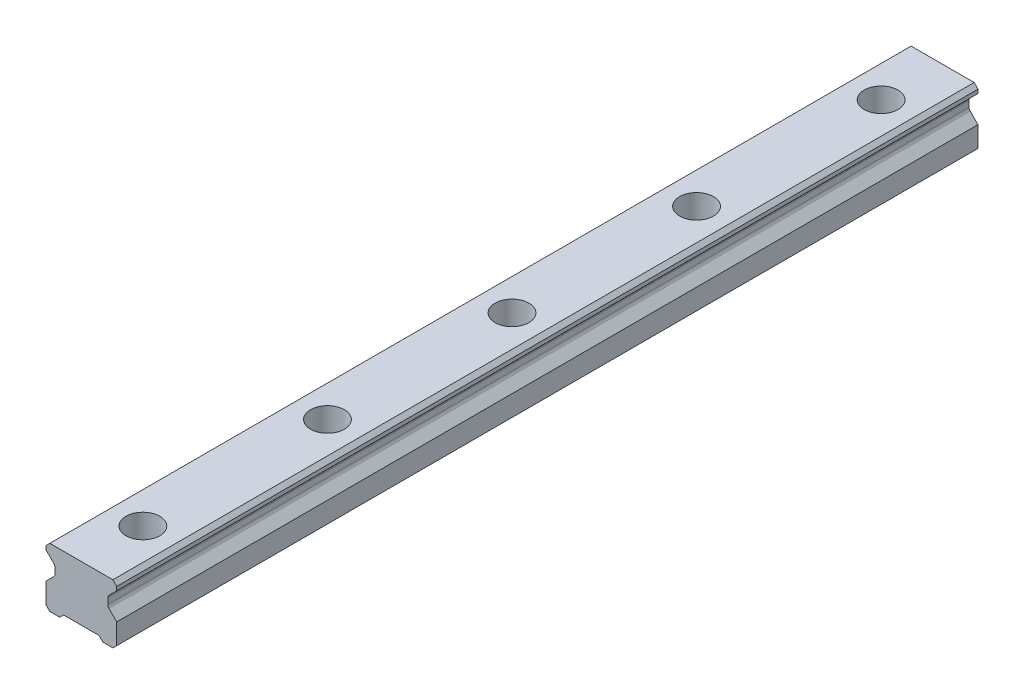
from build123d import *

# Parameters (mm, degrees)
SKETCH1_W           = 23
SKETCH1_H           = 19.2
BOSS_EXTRUDE1_DEPTH = 140
CUT_EXTRUDE1_DEPTH  = 281.893022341
CHAMFER1_SIZE       = 1.25
FILLET1_R           = 1.25
CUT_EXTRUDE2_DEPTH  = 281.893022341
SKETCH4_R           = 5.5
SKETCH4_R_2         = 3.5
CUT_EXTRUDE3_DEPTH  = 9
SKETCH4_2_R         = 3.5
CUT_EXTRUDE4_DEPTH  = 142.777607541
LPATTERN1_COUNT     = 5
LPATTERN1_PITCH     = 60


with BuildPart() as part:
    # Sketch1 → Boss-Extrude1 (new, symmetric)
    with BuildSketch(Plane.XY):
        with Locations((0, 9.6)):
            Rectangle(SKETCH1_W, SKETCH1_H)
    extrude(amount=BOSS_EXTRUDE1_DEPTH, both=True)

    # Sketch2 → Cut-Extrude1 (cut, through all)
    with BuildSketch(Plane.XY.offset(140)):
        Polygon((-11.5, 16.7), (-11.5, 7.95), (-8.583333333, 10.866666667), (-8.583333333, 13.783333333), align=None)
        Polygon((8.583333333, 13.783333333), (11.5, 16.7), (11.5, 7.95), (8.583333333, 10.866666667), align=None)
    extrude(amount=-CUT_EXTRUDE1_DEPTH, mode=Mode.SUBTRACT)

    # Chamfer1
    chamfer1_edges = [part.edges().sort_by_distance(p)[0] for p in [
        (-11.5, 19.2, 0),
        (11.5, 19.2, 0),
        (11.5, 0, 0),
        (-11.5, 0, 0),
    ]]
    chamfer(chamfer1_edges, length=CHAMFER1_SIZE)

    # Fillet1
    fillet1_edges = [part.edges().sort_by_distance(p)[0] for p in [
        (-8.583333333, 13.783333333, 0),
        (-8.583333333, 10.866666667, 0),
        (8.583333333, 10.866666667, 0),
        (8.583333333, 13.783333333, 0),
    ]]
    fillet(fillet1_edges, radius=FILLET1_R)

    # Sketch3 → Cut-Extrude2 (cut, through all)
    with BuildSketch(Plane.XY.offset(140)):
        Polygon((-7, 0), (-5.75, 1.25), (5.75, 1.25), (7, 0), align=None)
    extrude(amount=-CUT_EXTRUDE2_DEPTH, mode=Mode.SUBTRACT)

    # Sketch4 → Cut-Extrude3 (cut)
    with BuildSketch(Plane(origin=(0, 19.2, 0), x_dir=(1, 0, 0), z_dir=(0, 1, 0))):
        with Locations(Location((0, -120, 0), (0, 0, 270))):
            Circle(SKETCH4_R)
        with Locations(Location((0, -120, 0), (0, 0, 270))):
            Circle(SKETCH4_R_2, mode=Mode.SUBTRACT)
    cut_extrude3 = extrude(amount=-CUT_EXTRUDE3_DEPTH, mode=Mode.SUBTRACT)

    # Sketch4_2 → Cut-Extrude4 (cut, through all)
    with BuildSketch(Plane(origin=(0, 19.2, 0), x_dir=(1, 0, 0), z_dir=(0, 1, 0))):
        with Locations(Location((0, -120, 0), (0, 0, 270))):
            Circle(SKETCH4_2_R)
    cut_extrude4 = extrude(amount=-CUT_EXTRUDE4_DEPTH, mode=Mode.SUBTRACT)

    # LPattern1: Cut-Extrude3, Cut-Extrude4 ×5
    with Locations(*[(0, 0, -i * LPATTERN1_PITCH) for i in range(1, LPATTERN1_COUNT)]):
        add(cut_extrude3, mode=Mode.SUBTRACT)
        add(cut_extrude4, mode=Mode.SUBTRACT)


solid = part.part
